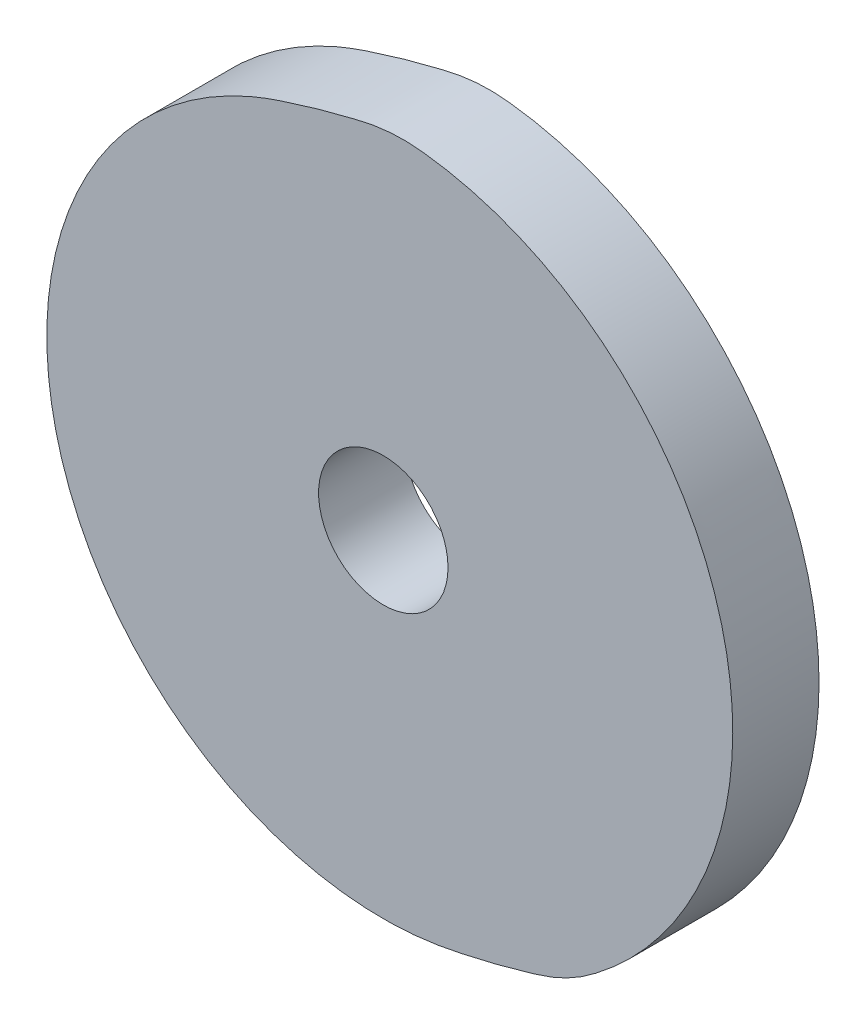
from build123d import *

# Parameters (mm, degrees)
SKIZZE1_R               = 7.5
LINEAR_AUSTRAGEN1_DEPTH = 5


with BuildPart() as part:
    # Skizze1 → Linear austragen1 (new, symmetric)
    with BuildSketch(Plane.XY):
        with BuildLine():
            add(Edge.make_bspline(
                [(-15.338722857, 35.856987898), (-70.630561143, 12.204521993), (-55.065599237, -45.884706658), (4.644770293, -38.722423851), (5.259849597, -38.648644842), (6.486492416, -38.471776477), (8.313383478, -38.115984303), (9.525193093, -37.857694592), (10.129845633, -37.722931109), (11.92346651, -37.323173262), (13.705389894, -36.874139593), (15.474262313, -36.376171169), (15.947165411, -36.243040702), (16.891009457, -35.969809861), (18.306900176, -35.551575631), (19.231021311, -35.215785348), (19.686277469, -35.031115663), (20.717700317, -34.612730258), (21.710694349, -34.109896), (22.658359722, -33.526106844), (22.976002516, -33.330429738), (23.600337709, -32.92129974), (24.502011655, -32.253977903), (25.089931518, -31.794410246), (25.380660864, -31.560609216), (57.33525165, -5.86311313), (46.722227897, 33.745230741), (6.199992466, 40.022619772), (5.831312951, 40.07973273), (5.092375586, 40.183770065), (3.977842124, 40.310850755), (3.232586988, 40.35300013), (2.859661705, 40.363640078), (1.74706484, 40.395383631), (0.635689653, 40.334353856), (-0.466741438, 40.180974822), (-0.953339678, 40.113275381), (-1.921547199, 39.942017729), (-3.356861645, 39.596273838), (-4.310869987, 39.360976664), (-4.786981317, 39.239819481), (-6.567853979, 38.786636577), (-8.335561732, 38.28454945), (-10.088761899, 37.733939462), (-10.679788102, 37.548321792), (-11.858390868, 37.166102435), (-13.618421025, 36.560781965), (-14.76915905, 36.100633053), (-15.338722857, 35.856987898)],
                knots=[0, 0, 0, 0, 0.394506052, 0.394506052, 0.394506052, 0.404001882, 0.413497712, 0.422993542, 0.422993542, 0.422993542, 0.45115452, 0.45115452, 0.45115452, 0.458685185, 0.466215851, 0.473746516, 0.473746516, 0.473746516, 0.490768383, 0.490768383, 0.490768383, 0.496487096, 0.502205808, 0.507924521, 0.507924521, 0.507924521, 0.886581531, 0.886581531, 0.886581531, 0.892300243, 0.898018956, 0.903737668, 0.903737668, 0.903737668, 0.920759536, 0.920759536, 0.920759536, 0.928290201, 0.935820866, 0.943351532, 0.943351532, 0.943351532, 0.97151251, 0.97151251, 0.97151251, 0.98100834, 0.99050417, 1, 1, 1, 1], degree=3, weights=[1, 0.427958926, 0.427958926, 1, 1, 1, 1, 1, 1, 0.999746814, 0.999746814, 1, 1, 1, 1, 1, 1, 0.997683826, 0.997683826, 1, 1, 1, 1, 1, 1, 0.602425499, 0.602425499, 1, 1, 1, 1, 1, 1, 0.997683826, 0.997683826, 1, 1, 1, 1, 1, 1, 0.999746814, 0.999746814, 1, 1, 1, 1, 1, 1]))
        make_face()
        Circle(SKIZZE1_R, mode=Mode.SUBTRACT)
    extrude(amount=LINEAR_AUSTRAGEN1_DEPTH, both=True)


solid = part.part
